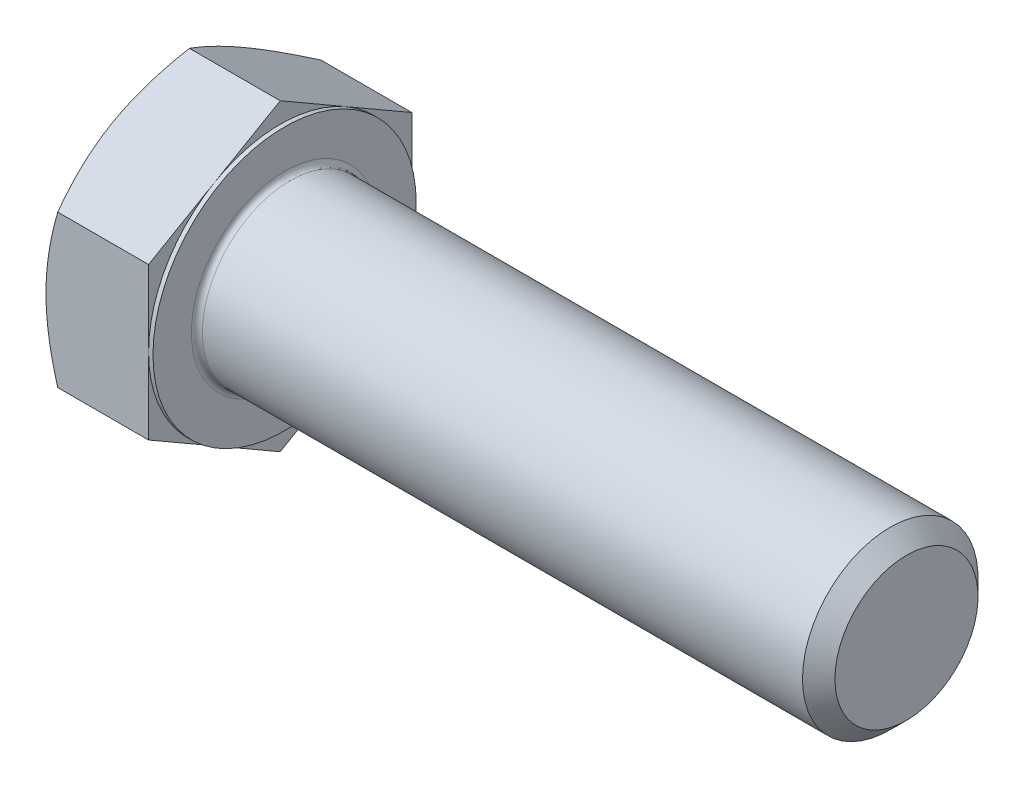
ISO-10303-21;
HEADER;
FILE_DESCRIPTION(('STEP AP214'),'2;1');
FILE_NAME('part.step','',(''),(''),'','','');
FILE_SCHEMA(('AUTOMOTIVE_DESIGN { 1 0 10303 214 1 1 1 1 }'));
ENDSEC;
DATA;
#1=APPLICATION_CONTEXT('core data for automotive mechanical design processes');
#2=APPLICATION_PROTOCOL_DEFINITION('international standard','automotive_design',2000,#1);
#3=PRODUCT_CONTEXT('',#1,'mechanical');
#4=PRODUCT('Part','Part','',(#3));
#5=PRODUCT_RELATED_PRODUCT_CATEGORY('part','',(#4));
#6=PRODUCT_DEFINITION_FORMATION('','',#4);
#7=PRODUCT_DEFINITION_CONTEXT('part definition',#1,'design');
#8=PRODUCT_DEFINITION('design','',#6,#7);
#9=PRODUCT_DEFINITION_SHAPE('','',#8);
#10=(LENGTH_UNIT() NAMED_UNIT(*) SI_UNIT(.MILLI.,.METRE.));
#11=(NAMED_UNIT(*) PLANE_ANGLE_UNIT() SI_UNIT($,.RADIAN.));
#12=(NAMED_UNIT(*) SI_UNIT($,.STERADIAN.) SOLID_ANGLE_UNIT());
#13=UNCERTAINTY_MEASURE_WITH_UNIT(LENGTH_MEASURE(1.E-05),#10,'distance_accuracy_value','');
#14=(GEOMETRIC_REPRESENTATION_CONTEXT(3) GLOBAL_UNCERTAINTY_ASSIGNED_CONTEXT((#13)) GLOBAL_UNIT_ASSIGNED_CONTEXT((#10,
#11,#12)) REPRESENTATION_CONTEXT('',''));
#15=CARTESIAN_POINT('',(0.,0.,0.));
#16=DIRECTION('',(0.,0.,1.));
#17=DIRECTION('',(1.,0.,0.));
#18=AXIS2_PLACEMENT_3D('',#15,#16,#17);
#19=CARTESIAN_POINT('',(15.478125,32.9955678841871,-19.05));
#20=DIRECTION('',(1.,0.,0.));
#21=DIRECTION('',(0.,0.,-1.));
#22=AXIS2_PLACEMENT_3D('',#19,#20,#21);
#23=PLANE('',#22);
#24=CARTESIAN_POINT('',(15.478125,0.,0.));
#25=DIRECTION('',(1.,0.,0.));
#26=DIRECTION('',(0.,0.,-1.));
#27=AXIS2_PLACEMENT_3D('',#24,#25,#26);
#28=CIRCLE('',#27,13.5);
#29=CARTESIAN_POINT('',(15.478125,0.,-13.5));
#30=VERTEX_POINT('',#29);
#31=EDGE_CURVE('E52',#30,#30,#28,.F.);
#32=ORIENTED_EDGE('',*,*,#31,.T.);
#33=EDGE_LOOP('',(#32));
#34=FACE_BOUND('',#33,.T.);
#35=CARTESIAN_POINT('',(15.478125,0.,0.));
#36=DIRECTION('',(1.,0.,0.));
#37=DIRECTION('',(0.,0.,-1.));
#38=AXIS2_PLACEMENT_3D('',#35,#36,#37);
#39=CIRCLE('',#38,19.05);
#40=CARTESIAN_POINT('',(15.478125,0.,-19.05));
#41=VERTEX_POINT('',#40);
#42=EDGE_CURVE('E176',#41,#41,#39,.T.);
#43=ORIENTED_EDGE('',*,*,#42,.T.);
#44=EDGE_LOOP('',(#43));
#45=FACE_BOUND('',#44,.T.);
#46=ADVANCED_FACE('F44',(#34,#45),#23,.T.);
#47=CARTESIAN_POINT('',(105.478125,0.,0.));
#48=DIRECTION('',(-1.,0.,0.));
#49=DIRECTION('',(0.,0.,1.));
#50=AXIS2_PLACEMENT_3D('',#47,#48,#49);
#51=PLANE('',#50);
#52=CARTESIAN_POINT('',(105.478125,0.,0.));
#53=DIRECTION('',(-1.,0.,0.));
#54=DIRECTION('',(0.,0.,1.));
#55=AXIS2_PLACEMENT_3D('',#52,#53,#54);
#56=CIRCLE('',#55,10.352);
#57=CARTESIAN_POINT('',(105.478125,0.,10.352));
#58=VERTEX_POINT('',#57);
#59=EDGE_CURVE('E340',#58,#58,#56,.T.);
#60=ORIENTED_EDGE('',*,*,#59,.F.);
#61=EDGE_LOOP('',(#60));
#62=FACE_BOUND('',#61,.T.);
#63=ADVANCED_FACE('F291',(#62),#51,.F.);
#64=CARTESIAN_POINT('',(105.478125,0.,0.));
#65=DIRECTION('',(-1.,0.,0.));
#66=DIRECTION('',(0.,0.,1.));
#67=AXIS2_PLACEMENT_3D('',#64,#65,#66);
#68=CONICAL_SURFACE('',#67,10.352,0.78539816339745);
#69=CARTESIAN_POINT('',(103.130125,0.,0.));
#70=DIRECTION('',(-1.,0.,0.));
#71=DIRECTION('',(0.,0.,1.));
#72=AXIS2_PLACEMENT_3D('',#69,#70,#71);
#73=CIRCLE('',#72,12.7);
#74=CARTESIAN_POINT('',(103.130125,0.,12.7));
#75=VERTEX_POINT('',#74);
#76=EDGE_CURVE('E334',#75,#75,#73,.T.);
#77=ORIENTED_EDGE('',*,*,#76,.F.);
#78=EDGE_LOOP('',(#77));
#79=FACE_BOUND('',#78,.T.);
#80=ORIENTED_EDGE('',*,*,#59,.T.);
#81=EDGE_LOOP('',(#80));
#82=FACE_BOUND('',#81,.T.);
#83=ADVANCED_FACE('F299',(#79,#82),#68,.T.);
#84=CARTESIAN_POINT('',(0.,0.,0.));
#85=DIRECTION('',(-1.,0.,0.));
#86=DIRECTION('',(0.,0.,1.));
#87=AXIS2_PLACEMENT_3D('',#84,#85,#86);
#88=CYLINDRICAL_SURFACE('',#87,12.7);
#89=CARTESIAN_POINT('',(16.278125,0.,0.));
#90=DIRECTION('',(1.,0.,0.));
#91=DIRECTION('',(0.,0.,-1.));
#92=AXIS2_PLACEMENT_3D('',#89,#90,#91);
#93=CIRCLE('',#92,12.7);
#94=CARTESIAN_POINT('',(16.278125,0.,-12.7));
#95=VERTEX_POINT('',#94);
#96=EDGE_CURVE('E11',#95,#95,#93,.T.);
#97=ORIENTED_EDGE('',*,*,#96,.T.);
#98=EDGE_LOOP('',(#97));
#99=FACE_BOUND('',#98,.T.);
#100=ORIENTED_EDGE('',*,*,#76,.T.);
#101=EDGE_LOOP('',(#100));
#102=FACE_BOUND('',#101,.T.);
#103=ADVANCED_FACE('F246',(#99,#102),#88,.T.);
#104=CARTESIAN_POINT('',(14.843125,21.9970452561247,0.));
#105=DIRECTION('',(1.,0.,0.));
#106=DIRECTION('',(0.,0.,-1.));
#107=AXIS2_PLACEMENT_3D('',#104,#105,#106);
#108=PLANE('',#107);
#109=DIRECTION('',(0.,1.,0.));
#110=VECTOR('',#109,1.);
#111=CARTESIAN_POINT('',(14.843125,-10.9985226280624,-19.05));
#112=LINE('',#111,#110);
#113=CARTESIAN_POINT('',(14.843125,-10.9985226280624,-19.05));
#114=VERTEX_POINT('',#113);
#115=CARTESIAN_POINT('',(14.843125,0.,-19.05));
#116=VERTEX_POINT('',#115);
#117=EDGE_CURVE('E203',#114,#116,#112,.T.);
#118=ORIENTED_EDGE('',*,*,#117,.T.);
#119=CARTESIAN_POINT('',(14.843125,0.,0.));
#120=DIRECTION('',(-1.,0.,0.));
#121=DIRECTION('',(0.,0.,1.));
#122=AXIS2_PLACEMENT_3D('',#119,#120,#121);
#123=CIRCLE('',#122,19.05);
#124=CARTESIAN_POINT('',(14.843125,-16.4977839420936,-9.525));
#125=VERTEX_POINT('',#124);
#126=EDGE_CURVE('E58',#116,#125,#123,.T.);
#127=ORIENTED_EDGE('',*,*,#126,.T.);
#128=DIRECTION('',(0.,0.5,-0.866025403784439));
#129=VECTOR('',#128,1.);
#130=CARTESIAN_POINT('',(14.843125,-21.9970452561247,0.));
#131=LINE('',#130,#129);
#132=EDGE_CURVE('E177',#125,#114,#131,.T.);
#133=ORIENTED_EDGE('',*,*,#132,.T.);
#134=EDGE_LOOP('',(#118,#127,#133));
#135=FACE_BOUND('',#134,.T.);
#136=ADVANCED_FACE('F200',(#135),#108,.T.);
#137=CARTESIAN_POINT('',(14.843125,10.9985226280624,-19.05));
#138=VERTEX_POINT('',#137);
#139=EDGE_CURVE('E206',#116,#138,#112,.T.);
#140=ORIENTED_EDGE('',*,*,#139,.T.);
#141=DIRECTION('',(0.,0.5,0.866025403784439));
#142=VECTOR('',#141,1.);
#143=CARTESIAN_POINT('',(14.843125,10.9985226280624,-19.05));
#144=LINE('',#143,#142);
#145=CARTESIAN_POINT('',(14.843125,16.4977839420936,-9.525));
#146=VERTEX_POINT('',#145);
#147=EDGE_CURVE('E212',#138,#146,#144,.T.);
#148=ORIENTED_EDGE('',*,*,#147,.T.);
#149=EDGE_CURVE('E354',#146,#116,#123,.T.);
#150=ORIENTED_EDGE('',*,*,#149,.T.);
#151=EDGE_LOOP('',(#140,#148,#150));
#152=FACE_BOUND('',#151,.T.);
#153=ADVANCED_FACE('F360',(#152),#108,.T.);
#154=CARTESIAN_POINT('',(14.843125,21.9970452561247,0.));
#155=VERTEX_POINT('',#154);
#156=EDGE_CURVE('E216',#146,#155,#144,.T.);
#157=ORIENTED_EDGE('',*,*,#156,.T.);
#158=DIRECTION('',(0.,-0.5,0.866025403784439));
#159=VECTOR('',#158,1.);
#160=CARTESIAN_POINT('',(14.843125,21.9970452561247,0.));
#161=LINE('',#160,#159);
#162=CARTESIAN_POINT('',(14.843125,16.4977839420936,9.525));
#163=VERTEX_POINT('',#162);
#164=EDGE_CURVE('E148',#155,#163,#161,.T.);
#165=ORIENTED_EDGE('',*,*,#164,.T.);
#166=EDGE_CURVE('E355',#163,#146,#123,.T.);
#167=ORIENTED_EDGE('',*,*,#166,.T.);
#168=EDGE_LOOP('',(#157,#165,#167));
#169=FACE_BOUND('',#168,.T.);
#170=ADVANCED_FACE('F362',(#169),#108,.T.);
#171=CARTESIAN_POINT('',(14.843125,10.9985226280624,19.05));
#172=VERTEX_POINT('',#171);
#173=EDGE_CURVE('E138',#163,#172,#161,.T.);
#174=ORIENTED_EDGE('',*,*,#173,.T.);
#175=DIRECTION('',(0.,-1.,0.));
#176=VECTOR('',#175,1.);
#177=CARTESIAN_POINT('',(14.843125,10.9985226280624,19.05));
#178=LINE('',#177,#176);
#179=CARTESIAN_POINT('',(14.843125,0.,19.05));
#180=VERTEX_POINT('',#179);
#181=EDGE_CURVE('E137',#172,#180,#178,.T.);
#182=ORIENTED_EDGE('',*,*,#181,.T.);
#183=EDGE_CURVE('E145',#180,#163,#123,.T.);
#184=ORIENTED_EDGE('',*,*,#183,.T.);
#185=EDGE_LOOP('',(#174,#182,#184));
#186=FACE_BOUND('',#185,.T.);
#187=ADVANCED_FACE('F136',(#186),#108,.T.);
#188=CARTESIAN_POINT('',(14.843125,-10.9985226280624,19.05));
#189=VERTEX_POINT('',#188);
#190=EDGE_CURVE('E155',#180,#189,#178,.T.);
#191=ORIENTED_EDGE('',*,*,#190,.T.);
#192=DIRECTION('',(0.,-0.5,-0.866025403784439));
#193=VECTOR('',#192,1.);
#194=CARTESIAN_POINT('',(14.843125,-10.9985226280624,19.05));
#195=LINE('',#194,#193);
#196=CARTESIAN_POINT('',(14.843125,-16.4977839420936,9.525));
#197=VERTEX_POINT('',#196);
#198=EDGE_CURVE('E347',#189,#197,#195,.T.);
#199=ORIENTED_EDGE('',*,*,#198,.T.);
#200=EDGE_CURVE('E351',#197,#180,#123,.T.);
#201=ORIENTED_EDGE('',*,*,#200,.T.);
#202=EDGE_LOOP('',(#191,#199,#201));
#203=FACE_BOUND('',#202,.T.);
#204=ADVANCED_FACE('F467',(#203),#108,.T.);
#205=CARTESIAN_POINT('',(14.843125,-21.9970452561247,0.));
#206=VERTEX_POINT('',#205);
#207=EDGE_CURVE('E195',#197,#206,#195,.T.);
#208=ORIENTED_EDGE('',*,*,#207,.T.);
#209=EDGE_CURVE('E179',#206,#125,#131,.T.);
#210=ORIENTED_EDGE('',*,*,#209,.T.);
#211=EDGE_CURVE('E188',#125,#197,#123,.T.);
#212=ORIENTED_EDGE('',*,*,#211,.T.);
#213=EDGE_LOOP('',(#208,#210,#212));
#214=FACE_BOUND('',#213,.T.);
#215=ADVANCED_FACE('F186',(#214),#108,.T.);
#216=CARTESIAN_POINT('',(0.,0.,0.));
#217=DIRECTION('',(-1.,0.,0.));
#218=DIRECTION('',(0.,0.,1.));
#219=AXIS2_PLACEMENT_3D('',#216,#217,#218);
#220=CYLINDRICAL_SURFACE('',#219,19.05);
#221=ORIENTED_EDGE('',*,*,#126,.F.);
#222=ORIENTED_EDGE('',*,*,#149,.F.);
#223=ORIENTED_EDGE('',*,*,#166,.F.);
#224=ORIENTED_EDGE('',*,*,#183,.F.);
#225=ORIENTED_EDGE('',*,*,#200,.F.);
#226=ORIENTED_EDGE('',*,*,#211,.F.);
#227=EDGE_LOOP('',(#221,#222,#223,#224,#225,#226));
#228=FACE_BOUND('',#227,.T.);
#229=ORIENTED_EDGE('',*,*,#42,.F.);
#230=EDGE_LOOP('',(#229));
#231=FACE_BOUND('',#230,.T.);
#232=ADVANCED_FACE('F306',(#228,#231),#220,.T.);
#233=CARTESIAN_POINT('',(0.,32.9955678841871,-19.05));
#234=DIRECTION('',(1.,0.,0.));
#235=DIRECTION('',(0.,0.,-1.));
#236=AXIS2_PLACEMENT_3D('',#233,#234,#235);
#237=PLANE('',#236);
#238=CARTESIAN_POINT('',(0.,0.,0.));
#239=DIRECTION('',(1.,0.,0.));
#240=DIRECTION('',(0.,0.,-1.));
#241=AXIS2_PLACEMENT_3D('',#238,#239,#240);
#242=CIRCLE('',#241,19.05);
#243=CARTESIAN_POINT('',(0.,0.,-19.05));
#244=VERTEX_POINT('',#243);
#245=CARTESIAN_POINT('',(0.,16.4977839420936,-9.525));
#246=VERTEX_POINT('',#245);
#247=EDGE_CURVE('E174',#244,#246,#242,.T.);
#248=ORIENTED_EDGE('',*,*,#247,.F.);
#249=CARTESIAN_POINT('',(0.,-16.4977839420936,-9.525));
#250=VERTEX_POINT('',#249);
#251=EDGE_CURVE('E171',#250,#244,#242,.T.);
#252=ORIENTED_EDGE('',*,*,#251,.F.);
#253=CARTESIAN_POINT('',(0.,-16.4977839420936,9.525));
#254=VERTEX_POINT('',#253);
#255=EDGE_CURVE('E172',#254,#250,#242,.T.);
#256=ORIENTED_EDGE('',*,*,#255,.F.);
#257=CARTESIAN_POINT('',(0.,0.,19.05));
#258=VERTEX_POINT('',#257);
#259=EDGE_CURVE('E544',#258,#254,#242,.T.);
#260=ORIENTED_EDGE('',*,*,#259,.F.);
#261=CARTESIAN_POINT('',(0.,0.,0.));
#262=DIRECTION('',(-1.,0.,0.));
#263=DIRECTION('',(0.,0.,1.));
#264=AXIS2_PLACEMENT_3D('',#261,#262,#263);
#265=CIRCLE('',#264,19.05);
#266=CARTESIAN_POINT('',(0.,16.4977839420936,9.525));
#267=VERTEX_POINT('',#266);
#268=EDGE_CURVE('E209',#258,#267,#265,.T.);
#269=ORIENTED_EDGE('',*,*,#268,.T.);
#270=EDGE_CURVE('E316',#246,#267,#242,.T.);
#271=ORIENTED_EDGE('',*,*,#270,.F.);
#272=EDGE_LOOP('',(#248,#252,#256,#260,#269,#271));
#273=FACE_BOUND('',#272,.T.);
#274=ADVANCED_FACE('F303',(#273),#237,.F.);
#275=CARTESIAN_POINT('',(0.,0.,0.));
#276=DIRECTION('',(1.,0.,0.));
#277=DIRECTION('',(0.,0.,-1.));
#278=AXIS2_PLACEMENT_3D('',#275,#276,#277);
#279=CONICAL_SURFACE('',#278,19.05,1.0471975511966);
#280=CARTESIAN_POINT('',(1.70154403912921,21.9971607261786,0.000199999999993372));
#281=CARTESIAN_POINT('',(1.56198341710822,21.7554177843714,-0.41851105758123));
#282=CARTESIAN_POINT('',(1.42875584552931,21.5127319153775,-0.838855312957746));
#283=CARTESIAN_POINT('',(1.1767271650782,21.0254141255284,-1.68291448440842));
#284=CARTESIAN_POINT('',(1.05793080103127,20.7807815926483,-2.10663046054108));
#285=CARTESIAN_POINT('',(0.836361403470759,20.2890976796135,-2.95825197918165));
#286=CARTESIAN_POINT('',(0.733626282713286,20.0420419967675,-3.38616497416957));
#287=CARTESIAN_POINT('',(0.546385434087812,19.5462139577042,-4.24496432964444));
#288=CARTESIAN_POINT('',(0.461878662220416,19.2974417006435,-4.67585051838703));
#289=CARTESIAN_POINT('',(0.314688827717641,18.8045548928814,-5.52955551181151));
#290=CARTESIAN_POINT('',(0.251518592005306,18.5604769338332,-5.95231093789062));
#291=CARTESIAN_POINT('',(0.145596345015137,18.0712026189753,-6.79975891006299));
#292=CARTESIAN_POINT('',(0.102844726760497,17.8260062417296,-7.22445149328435));
#293=CARTESIAN_POINT('',(0.0388391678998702,17.3352016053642,-8.07455006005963));
#294=CARTESIAN_POINT('',(0.0175596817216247,17.0895941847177,-8.49995459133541));
#295=CARTESIAN_POINT('',(-0.00304398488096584,16.5981526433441,-9.3511563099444));
#296=CARTESIAN_POINT('',(-0.00236884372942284,16.3523185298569,-9.77695348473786));
#297=CARTESIAN_POINT('',(0.0194033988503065,15.8927264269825,-10.5729903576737));
#298=CARTESIAN_POINT('',(0.0378455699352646,15.6789356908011,-10.9432867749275));
#299=CARTESIAN_POINT('',(0.0909844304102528,15.2518641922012,-11.6829963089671));
#300=CARTESIAN_POINT('',(0.125680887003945,15.0385834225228,-12.0524094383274));
#301=CARTESIAN_POINT('',(0.210726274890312,14.612612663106,-12.7902124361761));
#302=CARTESIAN_POINT('',(0.261089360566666,14.3999233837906,-13.1586010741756));
#303=CARTESIAN_POINT('',(0.376579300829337,13.9755573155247,-13.8936246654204));
#304=CARTESIAN_POINT('',(0.441706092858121,13.7638805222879,-14.2602596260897));
#305=CARTESIAN_POINT('',(0.660888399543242,13.121308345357,-15.3732272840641));
#306=CARTESIAN_POINT('',(0.83679916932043,12.6922737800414,-16.116336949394));
#307=CARTESIAN_POINT('',(1.23604434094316,11.840601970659,-17.5914757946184));
#308=CARTESIAN_POINT('',(1.45928498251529,11.4179538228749,-18.3235238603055));
#309=CARTESIAN_POINT('',(1.70154403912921,10.9984071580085,-19.0502));
#310=B_SPLINE_CURVE_WITH_KNOTS('',3,(#280,#281,#282,#283,#284,#285,#286,#287,#288,#289,#290,
#291,#292,#293,#294,#295,#296,#297,#298,#299,#300,#301,#302,#303,#304,#305,#306,#307,#308,#309),
.UNSPECIFIED.,.F.,.F.,(4,2,2,2,2,2,2,2,2,2,2,2,2,2,4),(0.,1.50971559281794,3.01992622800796,
4.53364959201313,6.04728623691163,7.52356313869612,8.99986845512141,10.4744153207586,
11.9489166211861,13.2325441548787,14.5161533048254,15.8009255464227,17.085692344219,
19.7118183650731,22.3327898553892),.UNSPECIFIED.);
#311=CARTESIAN_POINT('',(1.70147737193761,10.9985226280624,-19.05));
#312=VERTEX_POINT('',#311);
#313=EDGE_CURVE('E270',#246,#312,#310,.T.);
#314=ORIENTED_EDGE('',*,*,#313,.T.);
#315=CARTESIAN_POINT('',(9.11593373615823,-29.169702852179,-19.05));
#316=CARTESIAN_POINT('',(8.91378890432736,-28.7515170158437,-19.05));
#317=CARTESIAN_POINT('',(8.71269026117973,-28.3328257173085,-19.05));
#318=CARTESIAN_POINT('',(8.3128254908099,-27.494325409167,-19.05));
#319=CARTESIAN_POINT('',(8.11405938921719,-27.0745163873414,-19.05));
#320=CARTESIAN_POINT('',(7.52156252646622,-25.8131296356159,-19.05));
#321=CARTESIAN_POINT('',(7.13169909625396,-24.9697281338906,-19.05));
#322=CARTESIAN_POINT('',(6.36257122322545,-23.2722707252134,-19.05));
#323=CARTESIAN_POINT('',(5.9833802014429,-22.4181814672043,-19.05));
#324=CARTESIAN_POINT('',(5.24127883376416,-20.7029839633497,-19.05));
#325=CARTESIAN_POINT('',(4.87836763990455,-19.8418760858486,-19.05));
#326=CARTESIAN_POINT('',(4.16885698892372,-18.1005821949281,-19.05));
#327=CARTESIAN_POINT('',(3.8225124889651,-17.2202917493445,-19.05));
#328=CARTESIAN_POINT('',(3.15694792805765,-15.4493217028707,-19.05));
#329=CARTESIAN_POINT('',(2.83773088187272,-14.5586409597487,-19.05));
#330=CARTESIAN_POINT('',(2.23500280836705,-12.7673320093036,-19.05));
#331=CARTESIAN_POINT('',(1.95141586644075,-11.8667295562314,-19.05));
#332=CARTESIAN_POINT('',(1.42914392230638,-10.0526343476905,-19.05));
#333=CARTESIAN_POINT('',(1.19044473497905,-9.13914576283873,-19.05));
#334=CARTESIAN_POINT('',(0.87479986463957,-7.75907469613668,-19.05));
#335=CARTESIAN_POINT('',(0.776636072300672,-7.29731333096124,-19.05));
#336=CARTESIAN_POINT('',(0.595993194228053,-6.37071732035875,-19.05));
#337=CARTESIAN_POINT('',(0.513513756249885,-5.90588274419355,-19.05));
#338=CARTESIAN_POINT('',(0.365701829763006,-4.97345228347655,-19.05));
#339=CARTESIAN_POINT('',(0.300370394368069,-4.50585623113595,-19.05));
#340=CARTESIAN_POINT('',(0.188166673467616,-3.56843861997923,-19.05));
#341=CARTESIAN_POINT('',(0.141294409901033,-3.09861705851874,-19.05));
#342=CARTESIAN_POINT('',(0.0672708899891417,-2.16041609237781,-19.05));
#343=CARTESIAN_POINT('',(0.0399962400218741,-1.69204648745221,-19.05));
#344=CARTESIAN_POINT('',(0.0053113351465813,-0.754574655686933,-19.05));
#345=CARTESIAN_POINT('',(-0.00209921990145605,-0.285472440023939,-19.05));
#346=CARTESIAN_POINT('',(0.00311981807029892,0.652492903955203,-19.05));
#347=CARTESIAN_POINT('',(0.0157438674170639,1.12135606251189,-19.05));
#348=CARTESIAN_POINT('',(0.0607182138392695,2.05813737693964,-19.05));
#349=CARTESIAN_POINT('',(0.0930693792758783,2.52605549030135,-19.05));
#350=CARTESIAN_POINT('',(0.194680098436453,3.65980250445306,-19.05));
#351=CARTESIAN_POINT('',(0.273803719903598,4.32476458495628,-19.05));
#352=CARTESIAN_POINT('',(0.467485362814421,5.6494795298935,-19.05));
#353=CARTESIAN_POINT('',(0.582048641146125,6.30923160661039,-19.05));
#354=CARTESIAN_POINT('',(0.973151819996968,8.28182382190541,-19.05));
#355=CARTESIAN_POINT('',(1.29684470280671,9.58542312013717,-19.05));
#356=CARTESIAN_POINT('',(1.8549984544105,11.5353898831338,-19.05));
#357=CARTESIAN_POINT('',(2.05588340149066,12.1919454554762,-19.05));
#358=CARTESIAN_POINT('',(2.47768236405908,13.4987136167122,-19.05));
#359=CARTESIAN_POINT('',(2.69859818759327,14.1489256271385,-19.05));
#360=CARTESIAN_POINT('',(3.15575174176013,15.4397656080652,-19.05));
#361=CARTESIAN_POINT('',(3.39189604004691,16.0804269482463,-19.05));
#362=CARTESIAN_POINT('',(3.7563365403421,17.037384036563,-19.05));
#363=CARTESIAN_POINT('',(3.87949985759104,17.3556458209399,-19.05));
#364=CARTESIAN_POINT('',(4.12895791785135,17.9909330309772,-19.05));
#365=CARTESIAN_POINT('',(4.25525259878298,18.3079584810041,-19.05));
#366=CARTESIAN_POINT('',(4.3829716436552,18.6244086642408,-19.05));
#367=B_SPLINE_CURVE_WITH_KNOTS('',3,(#315,#316,#317,#318,#319,#320,#321,#322,#323,#324,#325,
#326,#327,#328,#329,#330,#331,#332,#333,#334,#335,#336,#337,#338,#339,#340,#341,#342,#343,#344,
#345,#346,#347,#348,#349,#350,#351,#352,#353,#354,#355,#356,#357,#358,#359,#360,#361,#362,#363,
#364,#365,#366),.UNSPECIFIED.,.F.,.F.,(4,2,2,2,2,2,2,2,2,2,2,2,2,2,2,2,2,2,2,2,2,2,2,2,2,4),(0.,
1.39343811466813,2.78689152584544,5.57425145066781,8.37756231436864,11.1807269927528,
14.0183059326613,16.856199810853,19.6879407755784,22.5187853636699,23.9348023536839,
25.3507875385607,26.7668596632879,28.1829334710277,29.5900111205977,30.9970675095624,
32.4037346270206,33.8104636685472,35.8182820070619,37.8263983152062,41.8503661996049,
43.9100054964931,45.9698308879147,48.0180400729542,49.0418117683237,50.065563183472),.UNSPECIFIED.);
#368=EDGE_CURVE('E325',#312,#244,#367,.F.);
#369=ORIENTED_EDGE('',*,*,#368,.T.);
#370=ORIENTED_EDGE('',*,*,#247,.T.);
#371=EDGE_LOOP('',(#314,#369,#370));
#372=FACE_BOUND('',#371,.T.);
#373=ADVANCED_FACE('F304',(#372),#279,.T.);
#374=CARTESIAN_POINT('',(1.7015440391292,10.9984071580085,19.0502));
#375=CARTESIAN_POINT('',(1.56198341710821,11.2401500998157,18.6314889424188));
#376=CARTESIAN_POINT('',(1.42875584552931,11.4828359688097,18.2111446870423));
#377=CARTESIAN_POINT('',(1.1767271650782,11.9701537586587,17.3670855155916));
#378=CARTESIAN_POINT('',(1.05793080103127,12.2147862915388,16.9433695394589));
#379=CARTESIAN_POINT('',(0.836361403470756,12.7064702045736,16.0917480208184));
#380=CARTESIAN_POINT('',(0.733626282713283,12.9535258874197,15.6638350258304));
#381=CARTESIAN_POINT('',(0.54638543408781,13.449353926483,14.8050356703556));
#382=CARTESIAN_POINT('',(0.461878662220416,13.6981261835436,14.374149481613));
#383=CARTESIAN_POINT('',(0.314688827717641,14.1910129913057,13.5204444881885));
#384=CARTESIAN_POINT('',(0.251518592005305,14.4350909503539,13.0976890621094));
#385=CARTESIAN_POINT('',(0.145596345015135,14.9243652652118,12.250241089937));
#386=CARTESIAN_POINT('',(0.102844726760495,15.1695616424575,11.8255485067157));
#387=CARTESIAN_POINT('',(0.0388391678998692,15.6603662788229,10.9754499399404));
#388=CARTESIAN_POINT('',(0.0175596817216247,15.9059736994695,10.5500454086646));
#389=CARTESIAN_POINT('',(-0.00304398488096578,16.397415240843,9.69884369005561));
#390=CARTESIAN_POINT('',(-0.00236884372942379,16.6432493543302,9.27304651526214));
#391=CARTESIAN_POINT('',(0.0194033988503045,17.1028414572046,8.47700964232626));
#392=CARTESIAN_POINT('',(0.0378455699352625,17.316632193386,8.10671322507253));
#393=CARTESIAN_POINT('',(0.09098443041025,17.7437036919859,7.36700369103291));
#394=CARTESIAN_POINT('',(0.125680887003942,17.9569844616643,6.9975905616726));
#395=CARTESIAN_POINT('',(0.210726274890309,18.3829552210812,6.25978756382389));
#396=CARTESIAN_POINT('',(0.261089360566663,18.5956445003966,5.89139892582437));
#397=CARTESIAN_POINT('',(0.376579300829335,19.0200105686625,5.15637533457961));
#398=CARTESIAN_POINT('',(0.441706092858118,19.2316873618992,4.78974037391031));
#399=CARTESIAN_POINT('',(0.660888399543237,19.8742595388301,3.67677271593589));
#400=CARTESIAN_POINT('',(0.836799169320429,20.3032941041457,2.93366305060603));
#401=CARTESIAN_POINT('',(1.23604434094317,21.1549659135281,1.45852420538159));
#402=CARTESIAN_POINT('',(1.4592849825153,21.5776140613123,0.726476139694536));
#403=CARTESIAN_POINT('',(1.70154403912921,21.9971607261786,-0.000200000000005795));
#404=B_SPLINE_CURVE_WITH_KNOTS('',3,(#374,#375,#376,#377,#378,#379,#380,#381,#382,#383,#384,
#385,#386,#387,#388,#389,#390,#391,#392,#393,#394,#395,#396,#397,#398,#399,#400,#401,#402,#403),
.UNSPECIFIED.,.F.,.F.,(4,2,2,2,2,2,2,2,2,2,2,2,2,2,4),(0.,1.50971559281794,3.01992622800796,
4.53364959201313,6.04728623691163,7.52356313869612,8.99986845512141,10.4744153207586,
11.9489166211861,13.2325441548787,14.5161533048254,15.8009255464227,17.085692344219,
19.7118183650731,22.3327898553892),.UNSPECIFIED.);
#405=CARTESIAN_POINT('',(1.70147737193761,21.9970452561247,0.));
#406=VERTEX_POINT('',#405);
#407=EDGE_CURVE('E274',#267,#406,#404,.T.);
#408=ORIENTED_EDGE('',*,*,#407,.T.);
#409=EDGE_CURVE('E69',#406,#246,#310,.T.);
#410=ORIENTED_EDGE('',*,*,#409,.T.);
#411=ORIENTED_EDGE('',*,*,#270,.T.);
#412=EDGE_LOOP('',(#408,#410,#411));
#413=FACE_BOUND('',#412,.T.);
#414=ADVANCED_FACE('F245',(#413),#279,.T.);
#415=CARTESIAN_POINT('',(1.70147737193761,10.9985226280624,19.05));
#416=VERTEX_POINT('',#415);
#417=EDGE_CURVE('E159',#416,#267,#404,.T.);
#418=ORIENTED_EDGE('',*,*,#417,.T.);
#419=ORIENTED_EDGE('',*,*,#268,.F.);
#420=CARTESIAN_POINT('',(9.11593373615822,-29.169702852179,19.05));
#421=CARTESIAN_POINT('',(8.91378890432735,-28.7515170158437,19.05));
#422=CARTESIAN_POINT('',(8.71269026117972,-28.3328257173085,19.05));
#423=CARTESIAN_POINT('',(8.31282549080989,-27.494325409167,19.05));
#424=CARTESIAN_POINT('',(8.11405938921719,-27.0745163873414,19.05));
#425=CARTESIAN_POINT('',(7.52156252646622,-25.8131296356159,19.05));
#426=CARTESIAN_POINT('',(7.13169909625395,-24.9697281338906,19.05));
#427=CARTESIAN_POINT('',(6.36257122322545,-23.2722707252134,19.05));
#428=CARTESIAN_POINT('',(5.98338020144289,-22.4181814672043,19.05));
#429=CARTESIAN_POINT('',(5.24127883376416,-20.7029839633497,19.05));
#430=CARTESIAN_POINT('',(4.87836763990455,-19.8418760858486,19.05));
#431=CARTESIAN_POINT('',(4.16885698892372,-18.1005821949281,19.05));
#432=CARTESIAN_POINT('',(3.8225124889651,-17.2202917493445,19.05));
#433=CARTESIAN_POINT('',(3.15694792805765,-15.4493217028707,19.05));
#434=CARTESIAN_POINT('',(2.83773088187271,-14.5586409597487,19.05));
#435=CARTESIAN_POINT('',(2.23500280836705,-12.7673320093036,19.05));
#436=CARTESIAN_POINT('',(1.95141586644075,-11.8667295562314,19.05));
#437=CARTESIAN_POINT('',(1.42914392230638,-10.0526343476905,19.05));
#438=CARTESIAN_POINT('',(1.19044473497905,-9.13914576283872,19.05));
#439=CARTESIAN_POINT('',(0.874799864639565,-7.75907469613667,19.05));
#440=CARTESIAN_POINT('',(0.776636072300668,-7.29731333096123,19.05));
#441=CARTESIAN_POINT('',(0.595993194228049,-6.37071732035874,19.05));
#442=CARTESIAN_POINT('',(0.513513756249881,-5.90588274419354,19.05));
#443=CARTESIAN_POINT('',(0.365701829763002,-4.97345228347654,19.05));
#444=CARTESIAN_POINT('',(0.300370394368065,-4.50585623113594,19.05));
#445=CARTESIAN_POINT('',(0.188166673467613,-3.56843861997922,19.05));
#446=CARTESIAN_POINT('',(0.141294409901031,-3.09861705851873,19.05));
#447=CARTESIAN_POINT('',(0.0672708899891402,-2.1604160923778,19.05));
#448=CARTESIAN_POINT('',(0.0399962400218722,-1.6920464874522,19.05));
#449=CARTESIAN_POINT('',(0.00531133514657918,-0.754574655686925,19.05));
#450=CARTESIAN_POINT('',(-0.00209921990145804,-0.285472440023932,19.05));
#451=CARTESIAN_POINT('',(0.00311981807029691,0.652492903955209,19.05));
#452=CARTESIAN_POINT('',(0.0157438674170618,1.12135606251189,19.05));
#453=CARTESIAN_POINT('',(0.0607182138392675,2.05813737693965,19.05));
#454=CARTESIAN_POINT('',(0.0930693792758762,2.52605549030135,19.05));
#455=CARTESIAN_POINT('',(0.194680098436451,3.65980250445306,19.05));
#456=CARTESIAN_POINT('',(0.273803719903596,4.32476458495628,19.05));
#457=CARTESIAN_POINT('',(0.467485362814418,5.64947952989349,19.05));
#458=CARTESIAN_POINT('',(0.582048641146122,6.30923160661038,19.05));
#459=CARTESIAN_POINT('',(0.973151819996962,8.2818238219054,19.05));
#460=CARTESIAN_POINT('',(1.2968447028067,9.58542312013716,19.05));
#461=CARTESIAN_POINT('',(1.8549984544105,11.5353898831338,19.05));
#462=CARTESIAN_POINT('',(2.05588340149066,12.1919454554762,19.05));
#463=CARTESIAN_POINT('',(2.47768236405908,13.4987136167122,19.05));
#464=CARTESIAN_POINT('',(2.69859818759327,14.1489256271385,19.05));
#465=CARTESIAN_POINT('',(3.15575174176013,15.4397656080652,19.05));
#466=CARTESIAN_POINT('',(3.39189604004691,16.0804269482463,19.05));
#467=CARTESIAN_POINT('',(3.7563365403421,17.037384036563,19.05));
#468=CARTESIAN_POINT('',(3.87949985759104,17.3556458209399,19.05));
#469=CARTESIAN_POINT('',(4.12895791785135,17.9909330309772,19.05));
#470=CARTESIAN_POINT('',(4.25525259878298,18.3079584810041,19.05));
#471=CARTESIAN_POINT('',(4.3829716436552,18.6244086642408,19.05));
#472=B_SPLINE_CURVE_WITH_KNOTS('',3,(#420,#421,#422,#423,#424,#425,#426,#427,#428,#429,#430,
#431,#432,#433,#434,#435,#436,#437,#438,#439,#440,#441,#442,#443,#444,#445,#446,#447,#448,#449,
#450,#451,#452,#453,#454,#455,#456,#457,#458,#459,#460,#461,#462,#463,#464,#465,#466,#467,#468,
#469,#470,#471),.UNSPECIFIED.,.F.,.F.,(4,2,2,2,2,2,2,2,2,2,2,2,2,2,2,2,2,2,2,2,2,2,2,2,2,4),(0.,
1.39343811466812,2.78689152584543,5.5742514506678,8.37756231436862,11.1807269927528,
14.0183059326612,16.8561998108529,19.6879407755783,22.5187853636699,23.9348023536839,
25.3507875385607,26.7668596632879,28.1829334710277,29.5900111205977,30.9970675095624,
32.4037346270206,33.8104636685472,35.8182820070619,37.8263983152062,41.8503661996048,
43.9100054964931,45.9698308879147,48.0180400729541,49.0418117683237,50.0655631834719),.UNSPECIFIED.);
#473=EDGE_CURVE('E331',#258,#416,#472,.T.);
#474=ORIENTED_EDGE('',*,*,#473,.T.);
#475=EDGE_LOOP('',(#418,#419,#474));
#476=FACE_BOUND('',#475,.T.);
#477=ADVANCED_FACE('F236',(#476),#279,.T.);
#478=CARTESIAN_POINT('',(1.70147737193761,-10.9985226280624,19.05));
#479=VERTEX_POINT('',#478);
#480=EDGE_CURVE('E259',#479,#258,#472,.T.);
#481=ORIENTED_EDGE('',*,*,#480,.T.);
#482=ORIENTED_EDGE('',*,*,#259,.T.);
#483=CARTESIAN_POINT('',(1.70154403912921,-21.9971607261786,-0.000200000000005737));
#484=CARTESIAN_POINT('',(1.56198341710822,-21.7554177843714,0.418511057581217));
#485=CARTESIAN_POINT('',(1.42875584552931,-21.5127319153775,0.838855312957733));
#486=CARTESIAN_POINT('',(1.1767271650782,-21.0254141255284,1.68291448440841));
#487=CARTESIAN_POINT('',(1.05793080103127,-20.7807815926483,2.10663046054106));
#488=CARTESIAN_POINT('',(0.836361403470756,-20.2890976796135,2.95825197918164));
#489=CARTESIAN_POINT('',(0.733626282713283,-20.0420419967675,3.38616497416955));
#490=CARTESIAN_POINT('',(0.54638543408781,-19.5462139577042,4.24496432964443));
#491=CARTESIAN_POINT('',(0.461878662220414,-19.2974417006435,4.67585051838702));
#492=CARTESIAN_POINT('',(0.31468882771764,-18.8045548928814,5.5295555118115));
#493=CARTESIAN_POINT('',(0.251518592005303,-18.5604769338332,5.95231093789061));
#494=CARTESIAN_POINT('',(0.145596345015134,-18.0712026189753,6.79975891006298));
#495=CARTESIAN_POINT('',(0.102844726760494,-17.8260062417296,7.22445149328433));
#496=CARTESIAN_POINT('',(0.038839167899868,-17.3352016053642,8.07455006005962));
#497=CARTESIAN_POINT('',(0.0175596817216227,-17.0895941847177,8.4999545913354));
#498=CARTESIAN_POINT('',(-0.00304398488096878,-16.5981526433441,9.35115630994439));
#499=CARTESIAN_POINT('',(-0.00236884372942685,-16.3523185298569,9.77695348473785));
#500=CARTESIAN_POINT('',(0.0194033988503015,-15.8927264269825,10.5729903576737));
#501=CARTESIAN_POINT('',(0.0378455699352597,-15.6789356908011,10.9432867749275));
#502=CARTESIAN_POINT('',(0.0909844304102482,-15.2518641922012,11.6829963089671));
#503=CARTESIAN_POINT('',(0.125680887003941,-15.0385834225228,12.0524094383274));
#504=CARTESIAN_POINT('',(0.210726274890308,-14.612612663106,12.7902124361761));
#505=CARTESIAN_POINT('',(0.261089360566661,-14.3999233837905,13.1586010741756));
#506=CARTESIAN_POINT('',(0.376579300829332,-13.9755573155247,13.8936246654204));
#507=CARTESIAN_POINT('',(0.441706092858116,-13.7638805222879,14.2602596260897));
#508=CARTESIAN_POINT('',(0.660888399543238,-13.121308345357,15.3732272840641));
#509=CARTESIAN_POINT('',(0.836799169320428,-12.6922737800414,16.116336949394));
#510=CARTESIAN_POINT('',(1.23604434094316,-11.840601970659,17.5914757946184));
#511=CARTESIAN_POINT('',(1.45928498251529,-11.4179538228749,18.3235238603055));
#512=CARTESIAN_POINT('',(1.7015440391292,-10.9984071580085,19.0502));
#513=B_SPLINE_CURVE_WITH_KNOTS('',3,(#483,#484,#485,#486,#487,#488,#489,#490,#491,#492,#493,
#494,#495,#496,#497,#498,#499,#500,#501,#502,#503,#504,#505,#506,#507,#508,#509,#510,#511,#512),
.UNSPECIFIED.,.F.,.F.,(4,2,2,2,2,2,2,2,2,2,2,2,2,2,4),(0.,1.50971559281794,3.01992622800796,
4.53364959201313,6.04728623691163,7.52356313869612,8.99986845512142,10.4744153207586,
11.9489166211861,13.2325441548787,14.5161533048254,15.8009255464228,17.085692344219,
19.7118183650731,22.3327898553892),.UNSPECIFIED.);
#514=EDGE_CURVE('E322',#254,#479,#513,.T.);
#515=ORIENTED_EDGE('',*,*,#514,.T.);
#516=EDGE_LOOP('',(#481,#482,#515));
#517=FACE_BOUND('',#516,.T.);
#518=ADVANCED_FACE('F241',(#517),#279,.T.);
#519=CARTESIAN_POINT('',(1.70147737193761,-10.9985226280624,-19.05));
#520=VERTEX_POINT('',#519);
#521=EDGE_CURVE('E251',#244,#520,#367,.F.);
#522=ORIENTED_EDGE('',*,*,#521,.T.);
#523=CARTESIAN_POINT('',(1.70154403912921,-10.9984071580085,-19.0502));
#524=CARTESIAN_POINT('',(1.56198341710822,-11.2401500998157,-18.6314889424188));
#525=CARTESIAN_POINT('',(1.42875584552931,-11.4828359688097,-18.2111446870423));
#526=CARTESIAN_POINT('',(1.17672716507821,-11.9701537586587,-17.3670855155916));
#527=CARTESIAN_POINT('',(1.05793080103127,-12.2147862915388,-16.9433695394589));
#528=CARTESIAN_POINT('',(0.83636140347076,-12.7064702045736,-16.0917480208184));
#529=CARTESIAN_POINT('',(0.733626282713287,-12.9535258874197,-15.6638350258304));
#530=CARTESIAN_POINT('',(0.546385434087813,-13.449353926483,-14.8050356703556));
#531=CARTESIAN_POINT('',(0.461878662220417,-13.6981261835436,-14.374149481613));
#532=CARTESIAN_POINT('',(0.314688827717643,-14.1910129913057,-13.5204444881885));
#533=CARTESIAN_POINT('',(0.251518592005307,-14.4350909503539,-13.0976890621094));
#534=CARTESIAN_POINT('',(0.145596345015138,-14.9243652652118,-12.250241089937));
#535=CARTESIAN_POINT('',(0.102844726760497,-15.1695616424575,-11.8255485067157));
#536=CARTESIAN_POINT('',(0.0388391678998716,-15.6603662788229,-10.9754499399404));
#537=CARTESIAN_POINT('',(0.0175596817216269,-15.9059736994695,-10.5500454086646));
#538=CARTESIAN_POINT('',(-0.00304398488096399,-16.397415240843,-9.69884369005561));
#539=CARTESIAN_POINT('',(-0.00236884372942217,-16.6432493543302,-9.27304651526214));
#540=CARTESIAN_POINT('',(0.0194033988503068,-17.1028414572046,-8.47700964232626));
#541=CARTESIAN_POINT('',(0.0378455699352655,-17.316632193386,-8.10671322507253));
#542=CARTESIAN_POINT('',(0.0909844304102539,-17.7437036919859,-7.36700369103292));
#543=CARTESIAN_POINT('',(0.125680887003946,-17.9569844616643,-6.9975905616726));
#544=CARTESIAN_POINT('',(0.210726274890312,-18.3829552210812,-6.25978756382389));
#545=CARTESIAN_POINT('',(0.261089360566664,-18.5956445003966,-5.89139892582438));
#546=CARTESIAN_POINT('',(0.376579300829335,-19.0200105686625,-5.15637533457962));
#547=CARTESIAN_POINT('',(0.44170609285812,-19.2316873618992,-4.78974037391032));
#548=CARTESIAN_POINT('',(0.660888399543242,-19.8742595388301,-3.6767727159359));
#549=CARTESIAN_POINT('',(0.836799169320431,-20.3032941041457,-2.93366305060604));
#550=CARTESIAN_POINT('',(1.23604434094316,-21.1549659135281,-1.4585242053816));
#551=CARTESIAN_POINT('',(1.45928498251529,-21.5776140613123,-0.72647613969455));
#552=CARTESIAN_POINT('',(1.70154403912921,-21.9971607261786,0.000199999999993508));
#553=B_SPLINE_CURVE_WITH_KNOTS('',3,(#523,#524,#525,#526,#527,#528,#529,#530,#531,#532,#533,
#534,#535,#536,#537,#538,#539,#540,#541,#542,#543,#544,#545,#546,#547,#548,#549,#550,#551,#552),
.UNSPECIFIED.,.F.,.F.,(4,2,2,2,2,2,2,2,2,2,2,2,2,2,4),(0.,1.50971559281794,3.01992622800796,
4.53364959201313,6.04728623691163,7.52356313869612,8.99986845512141,10.4744153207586,
11.9489166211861,13.2325441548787,14.5161533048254,15.8009255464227,17.085692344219,
19.7118183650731,22.3327898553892),.UNSPECIFIED.);
#554=EDGE_CURVE('E228',#520,#250,#553,.T.);
#555=ORIENTED_EDGE('',*,*,#554,.T.);
#556=ORIENTED_EDGE('',*,*,#251,.T.);
#557=EDGE_LOOP('',(#522,#555,#556));
#558=FACE_BOUND('',#557,.T.);
#559=ADVANCED_FACE('F370',(#558),#279,.T.);
#560=CARTESIAN_POINT('',(1.70147737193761,-21.9970452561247,0.));
#561=VERTEX_POINT('',#560);
#562=EDGE_CURVE('E227',#561,#254,#513,.T.);
#563=ORIENTED_EDGE('',*,*,#562,.T.);
#564=ORIENTED_EDGE('',*,*,#255,.T.);
#565=EDGE_CURVE('E215',#250,#561,#553,.T.);
#566=ORIENTED_EDGE('',*,*,#565,.T.);
#567=EDGE_LOOP('',(#563,#564,#566));
#568=FACE_BOUND('',#567,.T.);
#569=ADVANCED_FACE('F242',(#568),#279,.T.);
#570=CARTESIAN_POINT('',(15.478125,-21.9970452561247,0.));
#571=DIRECTION('',(0.,0.866025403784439,0.5));
#572=DIRECTION('',(0.,-0.5,0.866025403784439));
#573=AXIS2_PLACEMENT_3D('',#570,#571,#572);
#574=PLANE('',#573);
#575=ORIENTED_EDGE('',*,*,#209,.F.);
#576=DIRECTION('',(-1.,0.,0.));
#577=VECTOR('',#576,1.);
#578=CARTESIAN_POINT('',(15.478125,-21.9970452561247,0.));
#579=LINE('',#578,#577);
#580=EDGE_CURVE('E168',#206,#561,#579,.T.);
#581=ORIENTED_EDGE('',*,*,#580,.T.);
#582=ORIENTED_EDGE('',*,*,#565,.F.);
#583=ORIENTED_EDGE('',*,*,#554,.F.);
#584=DIRECTION('',(-1.,0.,0.));
#585=VECTOR('',#584,1.);
#586=CARTESIAN_POINT('',(15.478125,-10.9985226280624,-19.05));
#587=LINE('',#586,#585);
#588=EDGE_CURVE('E199',#114,#520,#587,.T.);
#589=ORIENTED_EDGE('',*,*,#588,.F.);
#590=ORIENTED_EDGE('',*,*,#132,.F.);
#591=EDGE_LOOP('',(#575,#581,#582,#583,#589,#590));
#592=FACE_BOUND('',#591,.T.);
#593=ADVANCED_FACE('F196',(#592),#574,.F.);
#594=CARTESIAN_POINT('',(15.478125,-10.9985226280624,19.05));
#595=DIRECTION('',(0.,0.866025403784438,-0.5));
#596=DIRECTION('',(0.,0.5,0.866025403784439));
#597=AXIS2_PLACEMENT_3D('',#594,#595,#596);
#598=PLANE('',#597);
#599=ORIENTED_EDGE('',*,*,#198,.F.);
#600=DIRECTION('',(-1.,0.,0.));
#601=VECTOR('',#600,1.);
#602=CARTESIAN_POINT('',(15.478125,-10.9985226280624,19.05));
#603=LINE('',#602,#601);
#604=EDGE_CURVE('E162',#189,#479,#603,.T.);
#605=ORIENTED_EDGE('',*,*,#604,.T.);
#606=ORIENTED_EDGE('',*,*,#514,.F.);
#607=ORIENTED_EDGE('',*,*,#562,.F.);
#608=ORIENTED_EDGE('',*,*,#580,.F.);
#609=ORIENTED_EDGE('',*,*,#207,.F.);
#610=EDGE_LOOP('',(#599,#605,#606,#607,#608,#609));
#611=FACE_BOUND('',#610,.T.);
#612=ADVANCED_FACE('F346',(#611),#598,.F.);
#613=CARTESIAN_POINT('',(15.478125,10.9985226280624,19.05));
#614=DIRECTION('',(0.,0.,-1.));
#615=DIRECTION('',(-1.,0.,0.));
#616=AXIS2_PLACEMENT_3D('',#613,#614,#615);
#617=PLANE('',#616);
#618=ORIENTED_EDGE('',*,*,#181,.F.);
#619=DIRECTION('',(-1.,0.,0.));
#620=VECTOR('',#619,1.);
#621=CARTESIAN_POINT('',(15.478125,10.9985226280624,19.05));
#622=LINE('',#621,#620);
#623=EDGE_CURVE('E152',#172,#416,#622,.T.);
#624=ORIENTED_EDGE('',*,*,#623,.T.);
#625=ORIENTED_EDGE('',*,*,#473,.F.);
#626=ORIENTED_EDGE('',*,*,#480,.F.);
#627=ORIENTED_EDGE('',*,*,#604,.F.);
#628=ORIENTED_EDGE('',*,*,#190,.F.);
#629=EDGE_LOOP('',(#618,#624,#625,#626,#627,#628));
#630=FACE_BOUND('',#629,.T.);
#631=ADVANCED_FACE('F149',(#630),#617,.F.);
#632=CARTESIAN_POINT('',(15.478125,21.9970452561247,0.));
#633=DIRECTION('',(0.,-0.866025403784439,-0.5));
#634=DIRECTION('',(0.,0.5,-0.866025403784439));
#635=AXIS2_PLACEMENT_3D('',#632,#633,#634);
#636=PLANE('',#635);
#637=ORIENTED_EDGE('',*,*,#164,.F.);
#638=DIRECTION('',(-1.,0.,0.));
#639=VECTOR('',#638,1.);
#640=CARTESIAN_POINT('',(15.478125,21.9970452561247,0.));
#641=LINE('',#640,#639);
#642=EDGE_CURVE('E163',#155,#406,#641,.T.);
#643=ORIENTED_EDGE('',*,*,#642,.T.);
#644=ORIENTED_EDGE('',*,*,#407,.F.);
#645=ORIENTED_EDGE('',*,*,#417,.F.);
#646=ORIENTED_EDGE('',*,*,#623,.F.);
#647=ORIENTED_EDGE('',*,*,#173,.F.);
#648=EDGE_LOOP('',(#637,#643,#644,#645,#646,#647));
#649=FACE_BOUND('',#648,.T.);
#650=ADVANCED_FACE('F156',(#649),#636,.F.);
#651=CARTESIAN_POINT('',(15.478125,10.9985226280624,-19.05));
#652=DIRECTION('',(0.,-0.866025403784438,0.5));
#653=DIRECTION('',(0.,-0.5,-0.866025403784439));
#654=AXIS2_PLACEMENT_3D('',#651,#652,#653);
#655=PLANE('',#654);
#656=ORIENTED_EDGE('',*,*,#147,.F.);
#657=DIRECTION('',(-1.,0.,0.));
#658=VECTOR('',#657,1.);
#659=CARTESIAN_POINT('',(15.478125,10.9985226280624,-19.05));
#660=LINE('',#659,#658);
#661=EDGE_CURVE('E165',#138,#312,#660,.T.);
#662=ORIENTED_EDGE('',*,*,#661,.T.);
#663=ORIENTED_EDGE('',*,*,#313,.F.);
#664=ORIENTED_EDGE('',*,*,#409,.F.);
#665=ORIENTED_EDGE('',*,*,#642,.F.);
#666=ORIENTED_EDGE('',*,*,#156,.F.);
#667=EDGE_LOOP('',(#656,#662,#663,#664,#665,#666));
#668=FACE_BOUND('',#667,.T.);
#669=ADVANCED_FACE('F281',(#668),#655,.F.);
#670=CARTESIAN_POINT('',(15.478125,-10.9985226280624,-19.05));
#671=DIRECTION('',(0.,0.,1.));
#672=DIRECTION('',(1.,0.,0.));
#673=AXIS2_PLACEMENT_3D('',#670,#671,#672);
#674=PLANE('',#673);
#675=ORIENTED_EDGE('',*,*,#117,.F.);
#676=ORIENTED_EDGE('',*,*,#588,.T.);
#677=ORIENTED_EDGE('',*,*,#521,.F.);
#678=ORIENTED_EDGE('',*,*,#368,.F.);
#679=ORIENTED_EDGE('',*,*,#661,.F.);
#680=ORIENTED_EDGE('',*,*,#139,.F.);
#681=EDGE_LOOP('',(#675,#676,#677,#678,#679,#680));
#682=FACE_BOUND('',#681,.T.);
#683=ADVANCED_FACE('F202',(#682),#674,.F.);
#684=CARTESIAN_POINT('',(16.278125,0.,0.));
#685=DIRECTION('',(1.,0.,0.));
#686=DIRECTION('',(0.,0.,-1.));
#687=AXIS2_PLACEMENT_3D('',#684,#685,#686);
#688=TOROIDAL_SURFACE('',#687,13.5,0.8);
#689=ORIENTED_EDGE('',*,*,#96,.F.);
#690=EDGE_LOOP('',(#689));
#691=FACE_BOUND('',#690,.T.);
#692=ORIENTED_EDGE('',*,*,#31,.F.);
#693=EDGE_LOOP('',(#692));
#694=FACE_BOUND('',#693,.T.);
#695=ADVANCED_FACE('F50',(#691,#694),#688,.F.);
#696=CLOSED_SHELL('',(#46,#63,#83,#103,#136,#153,#170,#187,#204,#215,#232,#274,#373,#414,#477,
#518,#559,#569,#593,#612,#631,#650,#669,#683,#695));
#697=MANIFOLD_SOLID_BREP('B2',#696);
#698=ADVANCED_BREP_SHAPE_REPRESENTATION('',(#18,#697),#14);
#699=SHAPE_DEFINITION_REPRESENTATION(#9,#698);
ENDSEC;
END-ISO-10303-21;
